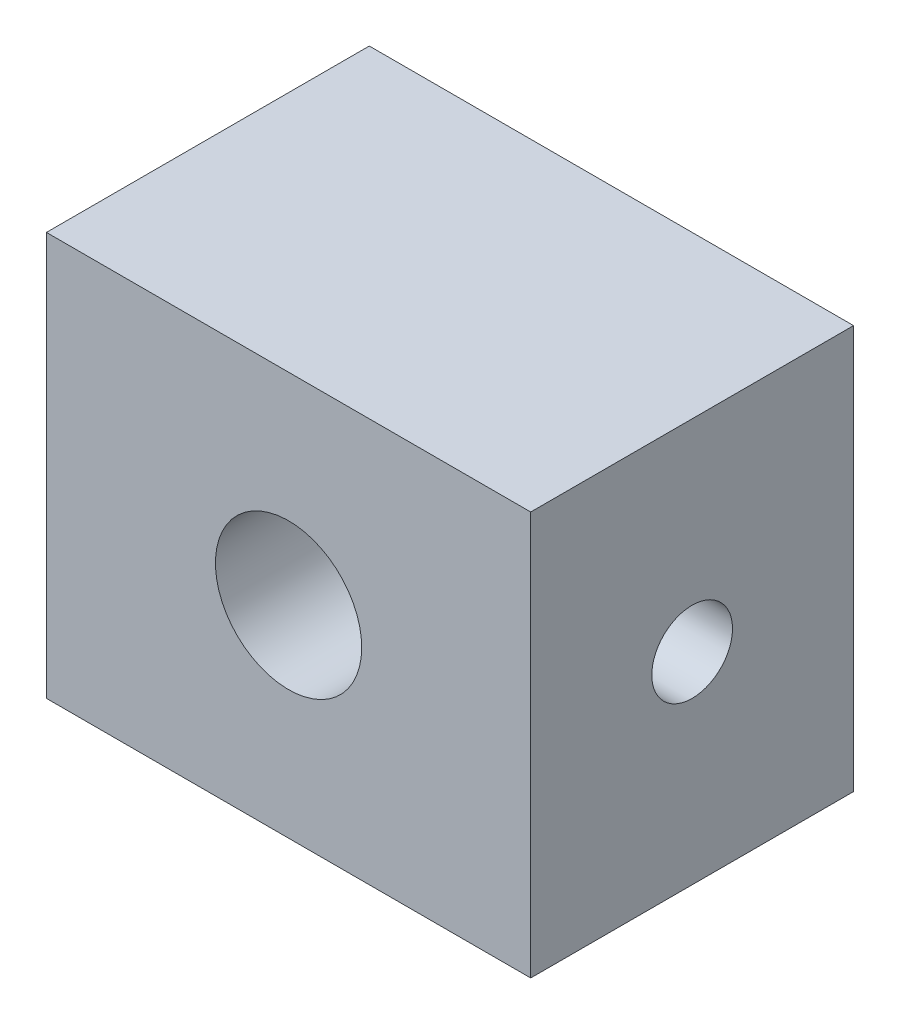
from build123d import *

# Parameters (mm, degrees)
SKETCH1_W               = 38.1
SKETCH1_H               = 31.75
BOSS_EXTRUDE1_DEPTH     = 12.7
F_1_2_20_TAPPED_HOLE1_D = 11.50874


with BuildPart() as part:
    # Sketch1 → Boss-Extrude1 (new, symmetric)
    with BuildSketch(Plane.XY):
        Rectangle(SKETCH1_W, SKETCH1_H)
    extrude(amount=BOSS_EXTRUDE1_DEPTH, both=True)

    # 1_2-20 Tapped Hole1 (through all)
    with Locations(Plane.XY.offset(12.7)):
        with Locations((0, 0)):
            Hole(F_1_2_20_TAPPED_HOLE1_D / 2)

    # Sketch4 → 1_4 _0.25_ Diameter Hole1 (revolve, cut)
    with BuildSketch(Plane(origin=(19.05, 0, 0), x_dir=(0, 0, -1), z_dir=(0, 1, 0))):
        Polygon((0, 0), (0, 10.797732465), (3.175, 8.89), (3.175, 0), align=None)
    f_1_4_0_25_diameter_hole1 = revolve(axis=Axis((25.4, 0, 0), (-1, 0, 0)), mode=Mode.SUBTRACT)

    # Mirror1: 1_4 _0.25_ Diameter Hole1 across plane
    add(f_1_4_0_25_diameter_hole1.mirror(Plane(origin=(0, 0, 0), x_dir=(0, 0, 1), z_dir=(1, 0, 0))), mode=Mode.SUBTRACT)


solid = part.part
